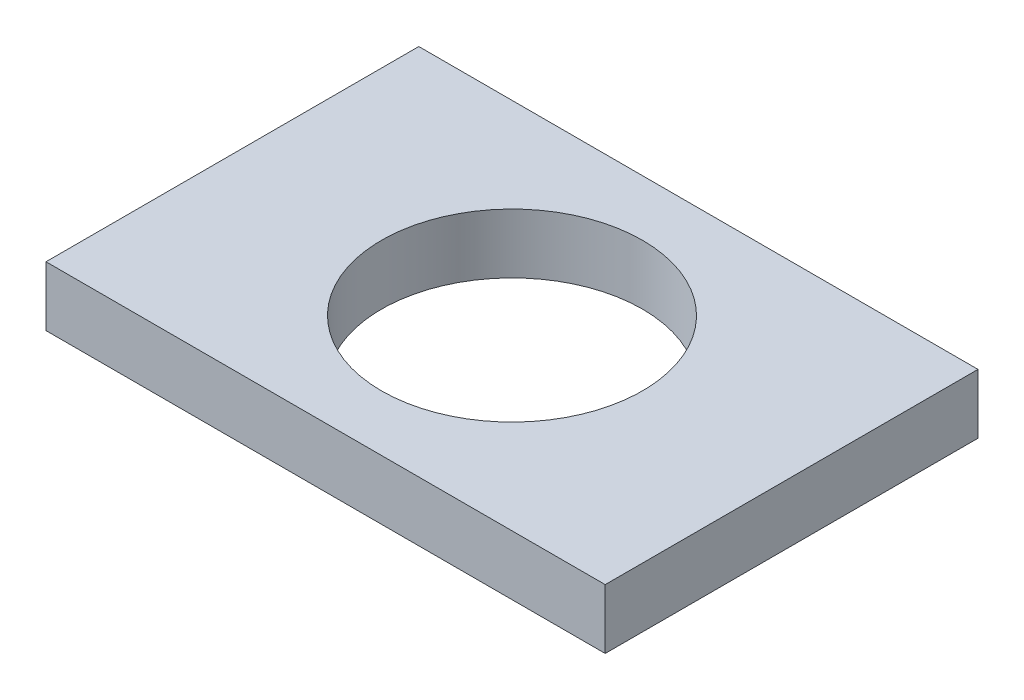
from build123d import *

# Parameters (mm, degrees)
ESQUISSE1_W             = 300
ESQUISSE1_H             = 32
EXTRUSION1_DEPTH        = 100
ESQUISSE2_R             = 70
ENL_V_MAT_EXTRU_1_DEPTH = 184.095603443


with BuildPart() as part:
    # Esquisse1 → Extrusion1 (new, symmetric)
    with BuildSketch(Plane.XY):
        with Locations((0, -16)):
            Rectangle(ESQUISSE1_W, ESQUISSE1_H)
    extrude(amount=EXTRUSION1_DEPTH, both=True)

    # Esquisse2 → Enl_v. mat.-Extru.1 (cut, through all)
    with BuildSketch(Plane(origin=(0, 0, 0), x_dir=(-1, 0, 0), z_dir=(0, 1, 0))):
        with Locations(Location((0, 0, 0), (0, 0, 90))):
            Circle(ESQUISSE2_R)
    extrude(amount=-ENL_V_MAT_EXTRU_1_DEPTH, mode=Mode.SUBTRACT)


solid = part.part
